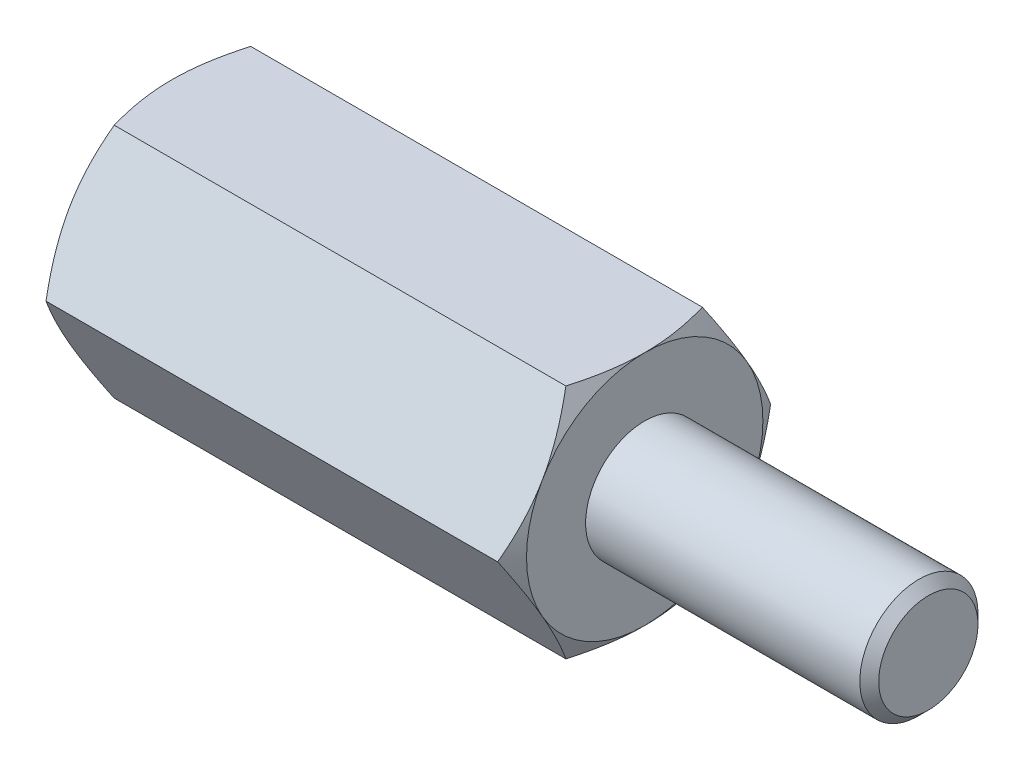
ISO-10303-21;
HEADER;
FILE_DESCRIPTION(('STEP AP214'),'2;1');
FILE_NAME('part.step','',(''),(''),'','','');
FILE_SCHEMA(('AUTOMOTIVE_DESIGN { 1 0 10303 214 1 1 1 1 }'));
ENDSEC;
DATA;
#1=APPLICATION_CONTEXT('core data for automotive mechanical design processes');
#2=APPLICATION_PROTOCOL_DEFINITION('international standard','automotive_design',2000,#1);
#3=PRODUCT_CONTEXT('',#1,'mechanical');
#4=PRODUCT('Part','Part','',(#3));
#5=PRODUCT_RELATED_PRODUCT_CATEGORY('part','',(#4));
#6=PRODUCT_DEFINITION_FORMATION('','',#4);
#7=PRODUCT_DEFINITION_CONTEXT('part definition',#1,'design');
#8=PRODUCT_DEFINITION('design','',#6,#7);
#9=PRODUCT_DEFINITION_SHAPE('','',#8);
#10=(LENGTH_UNIT() NAMED_UNIT(*) SI_UNIT(.MILLI.,.METRE.));
#11=(NAMED_UNIT(*) PLANE_ANGLE_UNIT() SI_UNIT($,.RADIAN.));
#12=(NAMED_UNIT(*) SI_UNIT($,.STERADIAN.) SOLID_ANGLE_UNIT());
#13=UNCERTAINTY_MEASURE_WITH_UNIT(LENGTH_MEASURE(1.E-05),#10,'distance_accuracy_value','');
#14=(GEOMETRIC_REPRESENTATION_CONTEXT(3) GLOBAL_UNCERTAINTY_ASSIGNED_CONTEXT((#13)) GLOBAL_UNIT_ASSIGNED_CONTEXT((#10,
#11,#12)) REPRESENTATION_CONTEXT('',''));
#15=CARTESIAN_POINT('',(0.,0.,0.));
#16=DIRECTION('',(0.,0.,1.));
#17=DIRECTION('',(1.,0.,0.));
#18=AXIS2_PLACEMENT_3D('',#15,#16,#17);
#19=CARTESIAN_POINT('',(5.,2.5,-1.44337567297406));
#20=DIRECTION('',(1.,0.,0.));
#21=DIRECTION('',(0.,0.,-1.));
#22=AXIS2_PLACEMENT_3D('',#19,#20,#21);
#23=PLANE('',#22);
#24=CARTESIAN_POINT('',(5.,0.,0.));
#25=DIRECTION('',(1.,0.,0.));
#26=DIRECTION('',(0.,0.,-1.));
#27=AXIS2_PLACEMENT_3D('',#24,#25,#26);
#28=CIRCLE('',#27,2.5);
#29=CARTESIAN_POINT('',(5.,-1.25,-2.1650635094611));
#30=VERTEX_POINT('',#29);
#31=CARTESIAN_POINT('',(5.,1.25,-2.1650635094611));
#32=VERTEX_POINT('',#31);
#33=EDGE_CURVE('E288',#30,#32,#28,.T.);
#34=ORIENTED_EDGE('',*,*,#33,.T.);
#35=CARTESIAN_POINT('',(5.,2.5,0.));
#36=VERTEX_POINT('',#35);
#37=EDGE_CURVE('E53',#32,#36,#28,.T.);
#38=ORIENTED_EDGE('',*,*,#37,.T.);
#39=CARTESIAN_POINT('',(5.,1.25,2.1650635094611));
#40=VERTEX_POINT('',#39);
#41=EDGE_CURVE('E295',#36,#40,#28,.T.);
#42=ORIENTED_EDGE('',*,*,#41,.T.);
#43=CARTESIAN_POINT('',(5.,-1.25,2.1650635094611));
#44=VERTEX_POINT('',#43);
#45=EDGE_CURVE('E300',#40,#44,#28,.T.);
#46=ORIENTED_EDGE('',*,*,#45,.T.);
#47=CARTESIAN_POINT('',(5.,0.,0.));
#48=DIRECTION('',(-1.,0.,0.));
#49=DIRECTION('',(0.,-1.,0.));
#50=AXIS2_PLACEMENT_3D('',#47,#48,#49);
#51=CIRCLE('',#50,2.5);
#52=CARTESIAN_POINT('',(5.,-2.5,0.));
#53=VERTEX_POINT('',#52);
#54=EDGE_CURVE('E193',#53,#44,#51,.T.);
#55=ORIENTED_EDGE('',*,*,#54,.F.);
#56=EDGE_CURVE('E61',#53,#30,#28,.T.);
#57=ORIENTED_EDGE('',*,*,#56,.T.);
#58=EDGE_LOOP('',(#34,#38,#42,#46,#55,#57));
#59=FACE_BOUND('',#58,.T.);
#60=CARTESIAN_POINT('',(5.,0.,0.));
#61=DIRECTION('',(1.,0.,0.));
#62=DIRECTION('',(0.,0.,-1.));
#63=AXIS2_PLACEMENT_3D('',#60,#61,#62);
#64=CIRCLE('',#63,1.25);
#65=CARTESIAN_POINT('',(5.,0.,-1.25));
#66=VERTEX_POINT('',#65);
#67=EDGE_CURVE('E328',#66,#66,#64,.T.);
#68=ORIENTED_EDGE('',*,*,#67,.F.);
#69=EDGE_LOOP('',(#68));
#70=FACE_BOUND('',#69,.T.);
#71=ADVANCED_FACE('F37',(#59,#70),#23,.T.);
#72=CARTESIAN_POINT('',(5.,0.,-2.88675134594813));
#73=DIRECTION('',(0.,-0.5,0.866025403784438));
#74=DIRECTION('',(0.,-0.866025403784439,-0.5));
#75=AXIS2_PLACEMENT_3D('',#72,#73,#74);
#76=PLANE('',#75);
#77=CARTESIAN_POINT('',(4.77664233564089,-0.000199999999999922,-2.88686681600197));
#78=CARTESIAN_POINT('',(4.81327837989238,0.109663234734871,-2.82343724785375));
#79=CARTESIAN_POINT('',(4.84659778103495,0.220474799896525,-2.75946016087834));
#80=CARTESIAN_POINT('',(4.90475771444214,0.444016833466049,-2.63039810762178));
#81=CARTESIAN_POINT('',(4.92957767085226,0.556751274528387,-2.5653108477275));
#82=CARTESIAN_POINT('',(4.96821434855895,0.780822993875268,-2.43594298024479));
#83=CARTESIAN_POINT('',(4.98228820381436,0.892125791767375,-2.37168227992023));
#84=CARTESIAN_POINT('',(4.99909084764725,1.11525522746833,-2.24285844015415));
#85=CARTESIAN_POINT('',(5.00183354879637,1.22708105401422,-2.17829576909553));
#86=CARTESIAN_POINT('',(4.99613423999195,1.43604197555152,-2.05765212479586));
#87=CARTESIAN_POINT('',(4.98909160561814,1.53320831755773,-2.0015531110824));
#88=CARTESIAN_POINT('',(4.96676858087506,1.726907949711,-1.88972057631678));
#89=CARTESIAN_POINT('',(4.95148056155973,1.82344056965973,-1.8339874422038));
#90=CARTESIAN_POINT('',(4.91326090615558,2.01753972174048,-1.7219242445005));
#91=CARTESIAN_POINT('',(4.89016722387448,2.11508168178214,-1.66560836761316));
#92=CARTESIAN_POINT('',(4.83775334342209,2.30871060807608,-1.55381665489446));
#93=CARTESIAN_POINT('',(4.80844546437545,2.40480005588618,-1.49833938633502));
#94=CARTESIAN_POINT('',(4.77664233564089,2.5002,-1.44326020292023));
#95=B_SPLINE_CURVE_WITH_KNOTS('',3,(#77,#78,#79,#80,#81,#82,#83,#84,#85,#86,#87,#88,#89,#90,#91,
#92,#93,#94),.UNSPECIFIED.,.F.,.F.,(4,2,2,2,2,2,2,2,4),(0.,0.396285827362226,0.79352433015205,
1.18093086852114,1.56786160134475,1.90479741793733,2.24204551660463,2.58677531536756,
2.93082800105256),.UNSPECIFIED.);
#96=CARTESIAN_POINT('',(4.7767090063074,0.,-2.88675134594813));
#97=VERTEX_POINT('',#96);
#98=EDGE_CURVE('E312',#97,#32,#95,.T.);
#99=ORIENTED_EDGE('',*,*,#98,.F.);
#100=DIRECTION('',(-1.,0.,0.));
#101=VECTOR('',#100,1.);
#102=CARTESIAN_POINT('',(5.,0.,-2.88675134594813));
#103=LINE('',#102,#101);
#104=CARTESIAN_POINT('',(-4.7767090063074,0.,-2.88675134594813));
#105=VERTEX_POINT('',#104);
#106=EDGE_CURVE('E264',#97,#105,#103,.T.);
#107=ORIENTED_EDGE('',*,*,#106,.T.);
#108=CARTESIAN_POINT('',(-4.77664233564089,2.5002,-1.44326020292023));
#109=CARTESIAN_POINT('',(-4.81327837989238,2.39033676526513,-1.50668977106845));
#110=CARTESIAN_POINT('',(-4.84659778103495,2.27952520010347,-1.57066685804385));
#111=CARTESIAN_POINT('',(-4.90475771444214,2.05598316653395,-1.69972891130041));
#112=CARTESIAN_POINT('',(-4.92957767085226,1.94324872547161,-1.7648161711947));
#113=CARTESIAN_POINT('',(-4.96821434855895,1.71917700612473,-1.8941840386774));
#114=CARTESIAN_POINT('',(-4.98228820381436,1.60787420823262,-1.95844473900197));
#115=CARTESIAN_POINT('',(-4.99909084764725,1.38474477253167,-2.08726857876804));
#116=CARTESIAN_POINT('',(-5.00183354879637,1.27291894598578,-2.15183124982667));
#117=CARTESIAN_POINT('',(-4.99613423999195,1.06395802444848,-2.27247489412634));
#118=CARTESIAN_POINT('',(-4.98909160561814,0.966791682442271,-2.32857390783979));
#119=CARTESIAN_POINT('',(-4.96676858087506,0.773092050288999,-2.44040644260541));
#120=CARTESIAN_POINT('',(-4.95148056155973,0.676559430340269,-2.49613957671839));
#121=CARTESIAN_POINT('',(-4.91326090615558,0.482460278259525,-2.60820277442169));
#122=CARTESIAN_POINT('',(-4.89016722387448,0.384918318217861,-2.66451865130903));
#123=CARTESIAN_POINT('',(-4.83775334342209,0.191289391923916,-2.77631036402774));
#124=CARTESIAN_POINT('',(-4.80844546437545,0.0951999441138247,-2.83178763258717));
#125=CARTESIAN_POINT('',(-4.77664233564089,-0.000199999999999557,-2.88686681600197));
#126=B_SPLINE_CURVE_WITH_KNOTS('',3,(#108,#109,#110,#111,#112,#113,#114,#115,#116,#117,#118,
#119,#120,#121,#122,#123,#124,#125),.UNSPECIFIED.,.F.,.F.,(4,2,2,2,2,2,2,2,4),(0.,
0.396285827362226,0.793524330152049,1.18093086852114,1.56786160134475,1.90479741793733,
2.24204551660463,2.58677531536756,2.93082800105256),.UNSPECIFIED.);
#127=CARTESIAN_POINT('',(-5.,1.25,-2.1650635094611));
#128=VERTEX_POINT('',#127);
#129=EDGE_CURVE('E319',#128,#105,#126,.T.);
#130=ORIENTED_EDGE('',*,*,#129,.F.);
#131=CARTESIAN_POINT('',(-4.7767090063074,2.5,-1.44337567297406));
#132=VERTEX_POINT('',#131);
#133=EDGE_CURVE('E322',#132,#128,#126,.T.);
#134=ORIENTED_EDGE('',*,*,#133,.F.);
#135=DIRECTION('',(-1.,0.,0.));
#136=VECTOR('',#135,1.);
#137=CARTESIAN_POINT('',(5.,2.5,-1.44337567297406));
#138=LINE('',#137,#136);
#139=CARTESIAN_POINT('',(4.77670900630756,2.5,-1.44337567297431));
#140=VERTEX_POINT('',#139);
#141=EDGE_CURVE('E279',#140,#132,#138,.T.);
#142=ORIENTED_EDGE('',*,*,#141,.F.);
#143=EDGE_CURVE('E229',#32,#140,#95,.T.);
#144=ORIENTED_EDGE('',*,*,#143,.F.);
#145=EDGE_LOOP('',(#99,#107,#130,#134,#142,#144));
#146=FACE_BOUND('',#145,.T.);
#147=ADVANCED_FACE('F148',(#146),#76,.F.);
#148=CARTESIAN_POINT('',(5.,2.5,-1.44337567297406));
#149=DIRECTION('',(0.,-1.,0.));
#150=DIRECTION('',(0.,0.,-1.));
#151=AXIS2_PLACEMENT_3D('',#148,#149,#150);
#152=PLANE('',#151);
#153=CARTESIAN_POINT('',(3.76803388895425,2.5,-3.90158441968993));
#154=CARTESIAN_POINT('',(3.82120772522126,2.5,-3.79217004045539));
#155=CARTESIAN_POINT('',(3.87387869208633,2.5,-3.68250707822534));
#156=CARTESIAN_POINT('',(3.97793249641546,2.5,-3.46255185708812));
#157=CARTESIAN_POINT('',(4.02931513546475,2.5,-3.35225950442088));
#158=CARTESIAN_POINT('',(4.13076309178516,2.5,-3.130356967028));
#159=CARTESIAN_POINT('',(4.18081992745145,2.5,-3.01874289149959));
#160=CARTESIAN_POINT('',(4.27891712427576,2.5,-2.79463535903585));
#161=CARTESIAN_POINT('',(4.32695757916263,2.5,-2.68214194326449));
#162=CARTESIAN_POINT('',(4.42201845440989,2.5,-2.45240385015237));
#163=CARTESIAN_POINT('',(4.46895431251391,2.5,-2.33512399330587));
#164=CARTESIAN_POINT('',(4.55933269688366,2.5,-2.09920133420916));
#165=CARTESIAN_POINT('',(4.60277483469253,2.5,-1.98055838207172));
#166=CARTESIAN_POINT('',(4.68504351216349,2.5,-1.74193489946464));
#167=CARTESIAN_POINT('',(4.72387917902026,2.5,-1.6219575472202));
#168=CARTESIAN_POINT('',(4.79570507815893,2.5,-1.38028205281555));
#169=CARTESIAN_POINT('',(4.82869712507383,2.5,-1.25858445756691));
#170=CARTESIAN_POINT('',(4.88709594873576,2.5,-1.01406369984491));
#171=CARTESIAN_POINT('',(4.91254379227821,2.5,-0.891250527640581));
#172=CARTESIAN_POINT('',(4.95442751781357,2.5,-0.644071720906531));
#173=CARTESIAN_POINT('',(4.97086432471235,2.5,-0.519706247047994));
#174=CARTESIAN_POINT('',(4.9932006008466,2.5,-0.271679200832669));
#175=CARTESIAN_POINT('',(4.99923751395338,2.5,-0.148030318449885));
#176=CARTESIAN_POINT('',(5.00062561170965,2.5,0.0993395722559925));
#177=CARTESIAN_POINT('',(4.99597656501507,2.5,0.223060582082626));
#178=CARTESIAN_POINT('',(4.97940443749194,2.5,0.432351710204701));
#179=CARTESIAN_POINT('',(4.97010665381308,2.5,0.518143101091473));
#180=CARTESIAN_POINT('',(4.94693847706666,2.5,0.689112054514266));
#181=CARTESIAN_POINT('',(4.93306748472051,2.5,0.774289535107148));
#182=CARTESIAN_POINT('',(4.88532020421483,2.5,1.02876599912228));
#183=CARTESIAN_POINT('',(4.84531764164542,2.5,1.19691958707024));
#184=CARTESIAN_POINT('',(4.75226567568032,2.5,1.53362893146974));
#185=CARTESIAN_POINT('',(4.69893620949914,2.5,1.70210423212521));
#186=CARTESIAN_POINT('',(4.61237169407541,2.5,1.95247339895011));
#187=CARTESIAN_POINT('',(4.58242477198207,2.5,2.03553184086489));
#188=CARTESIAN_POINT('',(4.52068409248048,2.5,2.20095860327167));
#189=CARTESIAN_POINT('',(4.48889037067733,2.5,2.2833269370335));
#190=CARTESIAN_POINT('',(4.40401426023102,2.5,2.49723312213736));
#191=CARTESIAN_POINT('',(4.34971733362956,2.5,2.6282879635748));
#192=CARTESIAN_POINT('',(4.23812739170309,2.5,2.88912034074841));
#193=CARTESIAN_POINT('',(4.1808341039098,2.5,3.01889775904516));
#194=CARTESIAN_POINT('',(4.06393487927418,2.5,3.27745045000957));
#195=CARTESIAN_POINT('',(4.00432825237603,2.5,3.40622540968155));
#196=CARTESIAN_POINT('',(3.8833234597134,2.5,3.66293235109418));
#197=CARTESIAN_POINT('',(3.82192524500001,2.5,3.79086430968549));
#198=CARTESIAN_POINT('',(3.6354580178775,2.5,4.17399495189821));
#199=CARTESIAN_POINT('',(3.50828249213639,2.5,4.42816724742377));
#200=CARTESIAN_POINT('',(3.25034557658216,2.5,4.93461464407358));
#201=CARTESIAN_POINT('',(3.11958483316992,2.5,5.18689007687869));
#202=CARTESIAN_POINT('',(2.86871001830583,2.5,5.66512451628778));
#203=CARTESIAN_POINT('',(2.74882986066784,2.5,5.89120644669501));
#204=CARTESIAN_POINT('',(2.50759021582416,2.5,6.34259369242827));
#205=CARTESIAN_POINT('',(2.38623065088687,2.5,6.56789896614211));
#206=CARTESIAN_POINT('',(2.14278038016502,2.5,7.01722044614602));
#207=CARTESIAN_POINT('',(2.02069305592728,2.5,7.24123848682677));
#208=CARTESIAN_POINT('',(1.77566624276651,2.5,7.68878772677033));
#209=CARTESIAN_POINT('',(1.65272681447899,2.5,7.9123189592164));
#210=CARTESIAN_POINT('',(1.52947566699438,2.5,8.13567697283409));
#211=B_SPLINE_CURVE_WITH_KNOTS('',3,(#153,#154,#155,#156,#157,#158,#159,#160,#161,#162,#163,
#164,#165,#166,#167,#168,#169,#170,#171,#172,#173,#174,#175,#176,#177,#178,#179,#180,#181,#182,
#183,#184,#185,#186,#187,#188,#189,#190,#191,#192,#193,#194,#195,#196,#197,#198,#199,#200,#201,
#202,#203,#204,#205,#206,#207,#208,#209,#210),.UNSPECIFIED.,.F.,.F.,(4,2,2,2,2,2,2,2,2,2,2,2,2,
2,2,2,2,2,2,2,2,2,2,2,2,2,2,2,4),(0.,0.364957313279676,0.729970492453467,1.09692930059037,
1.46387103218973,1.84279746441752,2.22176597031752,2.59997058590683,2.97805755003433,
3.35404692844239,3.72999770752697,4.10094071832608,4.47189175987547,4.73064905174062,
4.98944026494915,5.5072907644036,6.03710483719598,6.30196454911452,6.56681915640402,
6.99233818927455,7.41789598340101,7.84358170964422,8.26927907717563,9.12186602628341,
9.9743002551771,10.7419897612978,11.5097197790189,12.2750964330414,13.0404191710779),.UNSPECIFIED.);
#212=EDGE_CURVE('E227',#140,#36,#211,.T.);
#213=ORIENTED_EDGE('',*,*,#212,.F.);
#214=ORIENTED_EDGE('',*,*,#141,.T.);
#215=CARTESIAN_POINT('',(-3.76803388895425,2.5,-3.90158441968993));
#216=CARTESIAN_POINT('',(-3.82120772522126,2.5,-3.79217004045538));
#217=CARTESIAN_POINT('',(-3.87387869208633,2.5,-3.68250707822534));
#218=CARTESIAN_POINT('',(-3.97793249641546,2.5,-3.46255185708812));
#219=CARTESIAN_POINT('',(-4.02931513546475,2.5,-3.35225950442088));
#220=CARTESIAN_POINT('',(-4.13076309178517,2.5,-3.130356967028));
#221=CARTESIAN_POINT('',(-4.18081992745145,2.5,-3.01874289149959));
#222=CARTESIAN_POINT('',(-4.27891712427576,2.5,-2.79463535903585));
#223=CARTESIAN_POINT('',(-4.32695757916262,2.5,-2.68214194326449));
#224=CARTESIAN_POINT('',(-4.42201845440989,2.5,-2.45240385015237));
#225=CARTESIAN_POINT('',(-4.46895431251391,2.5,-2.33512399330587));
#226=CARTESIAN_POINT('',(-4.55933269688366,2.5,-2.09920133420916));
#227=CARTESIAN_POINT('',(-4.60277483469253,2.5,-1.98055838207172));
#228=CARTESIAN_POINT('',(-4.68504351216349,2.5,-1.74193489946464));
#229=CARTESIAN_POINT('',(-4.72387917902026,2.5,-1.6219575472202));
#230=CARTESIAN_POINT('',(-4.79570507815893,2.5,-1.38028205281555));
#231=CARTESIAN_POINT('',(-4.82869712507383,2.5,-1.25858445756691));
#232=CARTESIAN_POINT('',(-4.88709594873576,2.5,-1.01406369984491));
#233=CARTESIAN_POINT('',(-4.91254379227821,2.5,-0.891250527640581));
#234=CARTESIAN_POINT('',(-4.95442751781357,2.5,-0.64407172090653));
#235=CARTESIAN_POINT('',(-4.97086432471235,2.5,-0.519706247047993));
#236=CARTESIAN_POINT('',(-4.9932006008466,2.5,-0.271679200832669));
#237=CARTESIAN_POINT('',(-4.99923751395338,2.5,-0.148030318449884));
#238=CARTESIAN_POINT('',(-5.00062561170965,2.5,0.0993395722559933));
#239=CARTESIAN_POINT('',(-4.99597656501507,2.5,0.223060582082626));
#240=CARTESIAN_POINT('',(-4.97940443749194,2.5,0.432351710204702));
#241=CARTESIAN_POINT('',(-4.97010665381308,2.5,0.518143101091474));
#242=CARTESIAN_POINT('',(-4.94693847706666,2.5,0.689112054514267));
#243=CARTESIAN_POINT('',(-4.93306748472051,2.5,0.774289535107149));
#244=CARTESIAN_POINT('',(-4.88532020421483,2.5,1.02876599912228));
#245=CARTESIAN_POINT('',(-4.84531764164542,2.5,1.19691958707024));
#246=CARTESIAN_POINT('',(-4.75226567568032,2.5,1.53362893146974));
#247=CARTESIAN_POINT('',(-4.69893620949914,2.5,1.70210423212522));
#248=CARTESIAN_POINT('',(-4.61237169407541,2.5,1.95247339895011));
#249=CARTESIAN_POINT('',(-4.58242477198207,2.5,2.03553184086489));
#250=CARTESIAN_POINT('',(-4.52068409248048,2.5,2.20095860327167));
#251=CARTESIAN_POINT('',(-4.48889037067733,2.5,2.2833269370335));
#252=CARTESIAN_POINT('',(-4.40401426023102,2.5,2.49723312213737));
#253=CARTESIAN_POINT('',(-4.34971733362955,2.5,2.6282879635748));
#254=CARTESIAN_POINT('',(-4.23812739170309,2.5,2.88912034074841));
#255=CARTESIAN_POINT('',(-4.1808341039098,2.5,3.01889775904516));
#256=CARTESIAN_POINT('',(-4.06393487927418,2.5,3.27745045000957));
#257=CARTESIAN_POINT('',(-4.00432825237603,2.5,3.40622540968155));
#258=CARTESIAN_POINT('',(-3.8833234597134,2.5,3.66293235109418));
#259=CARTESIAN_POINT('',(-3.82192524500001,2.5,3.79086430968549));
#260=CARTESIAN_POINT('',(-3.6354580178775,2.5,4.17399495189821));
#261=CARTESIAN_POINT('',(-3.50828249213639,2.5,4.42816724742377));
#262=CARTESIAN_POINT('',(-3.25034557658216,2.5,4.93461464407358));
#263=CARTESIAN_POINT('',(-3.11958483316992,2.5,5.18689007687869));
#264=CARTESIAN_POINT('',(-2.86871001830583,2.5,5.66512451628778));
#265=CARTESIAN_POINT('',(-2.74882986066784,2.5,5.89120644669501));
#266=CARTESIAN_POINT('',(-2.50759021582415,2.5,6.34259369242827));
#267=CARTESIAN_POINT('',(-2.38623065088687,2.5,6.56789896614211));
#268=CARTESIAN_POINT('',(-2.14278038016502,2.5,7.01722044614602));
#269=CARTESIAN_POINT('',(-2.02069305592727,2.5,7.24123848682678));
#270=CARTESIAN_POINT('',(-1.77566624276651,2.5,7.68878772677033));
#271=CARTESIAN_POINT('',(-1.65272681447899,2.5,7.9123189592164));
#272=CARTESIAN_POINT('',(-1.52947566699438,2.5,8.13567697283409));
#273=B_SPLINE_CURVE_WITH_KNOTS('',3,(#215,#216,#217,#218,#219,#220,#221,#222,#223,#224,#225,
#226,#227,#228,#229,#230,#231,#232,#233,#234,#235,#236,#237,#238,#239,#240,#241,#242,#243,#244,
#245,#246,#247,#248,#249,#250,#251,#252,#253,#254,#255,#256,#257,#258,#259,#260,#261,#262,#263,
#264,#265,#266,#267,#268,#269,#270,#271,#272),.UNSPECIFIED.,.F.,.F.,(4,2,2,2,2,2,2,2,2,2,2,2,2,
2,2,2,2,2,2,2,2,2,2,2,2,2,2,2,4),(0.,0.364957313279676,0.729970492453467,1.09692930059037,
1.46387103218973,1.84279746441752,2.22176597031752,2.59997058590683,2.97805755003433,
3.35404692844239,3.72999770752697,4.10094071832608,4.47189175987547,4.73064905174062,
4.98944026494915,5.5072907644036,6.03710483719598,6.30196454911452,6.56681915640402,
6.99233818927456,7.41789598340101,7.84358170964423,8.26927907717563,9.12186602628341,
9.97430025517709,10.7419897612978,11.5097197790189,12.2750964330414,13.0404191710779),.UNSPECIFIED.);
#274=CARTESIAN_POINT('',(-5.,2.5,0.));
#275=VERTEX_POINT('',#274);
#276=EDGE_CURVE('E241',#275,#132,#273,.F.);
#277=ORIENTED_EDGE('',*,*,#276,.F.);
#278=CARTESIAN_POINT('',(-4.7767090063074,2.5,1.44337567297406));
#279=VERTEX_POINT('',#278);
#280=EDGE_CURVE('E249',#279,#275,#273,.F.);
#281=ORIENTED_EDGE('',*,*,#280,.F.);
#282=DIRECTION('',(-1.,0.,0.));
#283=VECTOR('',#282,1.);
#284=CARTESIAN_POINT('',(5.,2.5,1.44337567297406));
#285=LINE('',#284,#283);
#286=CARTESIAN_POINT('',(4.7767090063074,2.5,1.44337567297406));
#287=VERTEX_POINT('',#286);
#288=EDGE_CURVE('E276',#287,#279,#285,.T.);
#289=ORIENTED_EDGE('',*,*,#288,.F.);
#290=EDGE_CURVE('E221',#36,#287,#211,.T.);
#291=ORIENTED_EDGE('',*,*,#290,.F.);
#292=EDGE_LOOP('',(#213,#214,#277,#281,#289,#291));
#293=FACE_BOUND('',#292,.T.);
#294=ADVANCED_FACE('F153',(#293),#152,.F.);
#295=CARTESIAN_POINT('',(5.,2.5,1.44337567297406));
#296=DIRECTION('',(0.,-0.5,-0.866025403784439));
#297=DIRECTION('',(0.,0.866025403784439,-0.5));
#298=AXIS2_PLACEMENT_3D('',#295,#296,#297);
#299=PLANE('',#298);
#300=CARTESIAN_POINT('',(4.77664233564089,2.5002,1.44326020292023));
#301=CARTESIAN_POINT('',(4.81327837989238,2.39033676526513,1.50668977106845));
#302=CARTESIAN_POINT('',(4.84659778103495,2.27952520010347,1.57066685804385));
#303=CARTESIAN_POINT('',(4.90475771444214,2.05598316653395,1.69972891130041));
#304=CARTESIAN_POINT('',(4.92957767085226,1.94324872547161,1.7648161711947));
#305=CARTESIAN_POINT('',(4.96821434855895,1.71917700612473,1.8941840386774));
#306=CARTESIAN_POINT('',(4.98228820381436,1.60787420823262,1.95844473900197));
#307=CARTESIAN_POINT('',(4.99909084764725,1.38474477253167,2.08726857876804));
#308=CARTESIAN_POINT('',(5.00183354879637,1.27291894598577,2.15183124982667));
#309=CARTESIAN_POINT('',(4.99613423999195,1.06395802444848,2.27247489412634));
#310=CARTESIAN_POINT('',(4.98909160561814,0.96679168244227,2.32857390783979));
#311=CARTESIAN_POINT('',(4.96676858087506,0.773092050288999,2.44040644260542));
#312=CARTESIAN_POINT('',(4.95148056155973,0.676559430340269,2.49613957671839));
#313=CARTESIAN_POINT('',(4.91326090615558,0.482460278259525,2.60820277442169));
#314=CARTESIAN_POINT('',(4.89016722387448,0.384918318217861,2.66451865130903));
#315=CARTESIAN_POINT('',(4.83775334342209,0.191289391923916,2.77631036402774));
#316=CARTESIAN_POINT('',(4.80844546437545,0.0951999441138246,2.83178763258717));
#317=CARTESIAN_POINT('',(4.77664233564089,-0.000199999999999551,2.88686681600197));
#318=B_SPLINE_CURVE_WITH_KNOTS('',3,(#300,#301,#302,#303,#304,#305,#306,#307,#308,#309,#310,
#311,#312,#313,#314,#315,#316,#317),.UNSPECIFIED.,.F.,.F.,(4,2,2,2,2,2,2,2,4),(0.,
0.396285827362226,0.79352433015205,1.18093086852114,1.56786160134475,1.90479741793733,
2.24204551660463,2.58677531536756,2.93082800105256),.UNSPECIFIED.);
#319=EDGE_CURVE('E228',#287,#40,#318,.T.);
#320=ORIENTED_EDGE('',*,*,#319,.F.);
#321=ORIENTED_EDGE('',*,*,#288,.T.);
#322=CARTESIAN_POINT('',(-4.77664233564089,-0.000199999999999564,2.88686681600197));
#323=CARTESIAN_POINT('',(-4.81327837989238,0.109663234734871,2.82343724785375));
#324=CARTESIAN_POINT('',(-4.84659778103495,0.220474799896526,2.75946016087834));
#325=CARTESIAN_POINT('',(-4.90475771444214,0.44401683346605,2.63039810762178));
#326=CARTESIAN_POINT('',(-4.92957767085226,0.556751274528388,2.5653108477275));
#327=CARTESIAN_POINT('',(-4.96821434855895,0.780822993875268,2.43594298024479));
#328=CARTESIAN_POINT('',(-4.98228820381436,0.892125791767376,2.37168227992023));
#329=CARTESIAN_POINT('',(-4.99909084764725,1.11525522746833,2.24285844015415));
#330=CARTESIAN_POINT('',(-5.00183354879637,1.22708105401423,2.17829576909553));
#331=CARTESIAN_POINT('',(-4.99613423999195,1.43604197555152,2.05765212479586));
#332=CARTESIAN_POINT('',(-4.98909160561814,1.53320831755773,2.0015531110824));
#333=CARTESIAN_POINT('',(-4.96676858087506,1.726907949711,1.88972057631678));
#334=CARTESIAN_POINT('',(-4.95148056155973,1.82344056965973,1.8339874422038));
#335=CARTESIAN_POINT('',(-4.91326090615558,2.01753972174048,1.7219242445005));
#336=CARTESIAN_POINT('',(-4.89016722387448,2.11508168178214,1.66560836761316));
#337=CARTESIAN_POINT('',(-4.83775334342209,2.30871060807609,1.55381665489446));
#338=CARTESIAN_POINT('',(-4.80844546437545,2.40480005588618,1.49833938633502));
#339=CARTESIAN_POINT('',(-4.77664233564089,2.5002,1.44326020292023));
#340=B_SPLINE_CURVE_WITH_KNOTS('',3,(#322,#323,#324,#325,#326,#327,#328,#329,#330,#331,#332,
#333,#334,#335,#336,#337,#338,#339),.UNSPECIFIED.,.F.,.F.,(4,2,2,2,2,2,2,2,4),(0.,
0.396285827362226,0.79352433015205,1.18093086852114,1.56786160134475,1.90479741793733,
2.24204551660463,2.58677531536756,2.93082800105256),.UNSPECIFIED.);
#341=CARTESIAN_POINT('',(-5.,1.25,2.1650635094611));
#342=VERTEX_POINT('',#341);
#343=EDGE_CURVE('E255',#342,#279,#340,.T.);
#344=ORIENTED_EDGE('',*,*,#343,.F.);
#345=CARTESIAN_POINT('',(-4.7767090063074,0.,2.88675134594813));
#346=VERTEX_POINT('',#345);
#347=EDGE_CURVE('E262',#346,#342,#340,.T.);
#348=ORIENTED_EDGE('',*,*,#347,.F.);
#349=DIRECTION('',(-1.,0.,0.));
#350=VECTOR('',#349,1.);
#351=CARTESIAN_POINT('',(5.,0.,2.88675134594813));
#352=LINE('',#351,#350);
#353=CARTESIAN_POINT('',(4.7767090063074,0.,2.88675134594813));
#354=VERTEX_POINT('',#353);
#355=EDGE_CURVE('E273',#354,#346,#352,.T.);
#356=ORIENTED_EDGE('',*,*,#355,.F.);
#357=EDGE_CURVE('E215',#40,#354,#318,.T.);
#358=ORIENTED_EDGE('',*,*,#357,.F.);
#359=EDGE_LOOP('',(#320,#321,#344,#348,#356,#358));
#360=FACE_BOUND('',#359,.T.);
#361=ADVANCED_FACE('F235',(#360),#299,.F.);
#362=CARTESIAN_POINT('',(5.,0.,2.88675134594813));
#363=DIRECTION('',(0.,0.5,-0.866025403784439));
#364=DIRECTION('',(0.,0.866025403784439,0.5));
#365=AXIS2_PLACEMENT_3D('',#362,#363,#364);
#366=PLANE('',#365);
#367=CARTESIAN_POINT('',(4.77664233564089,0.000200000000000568,2.88686681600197));
#368=CARTESIAN_POINT('',(4.81327837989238,-0.10966323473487,2.82343724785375));
#369=CARTESIAN_POINT('',(4.84659778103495,-0.220474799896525,2.75946016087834));
#370=CARTESIAN_POINT('',(4.90475771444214,-0.444016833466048,2.63039810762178));
#371=CARTESIAN_POINT('',(4.92957767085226,-0.556751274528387,2.5653108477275));
#372=CARTESIAN_POINT('',(4.96821434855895,-0.780822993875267,2.43594298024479));
#373=CARTESIAN_POINT('',(4.98228820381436,-0.892125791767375,2.37168227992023));
#374=CARTESIAN_POINT('',(4.99909084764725,-1.11525522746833,2.24285844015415));
#375=CARTESIAN_POINT('',(5.00183354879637,-1.22708105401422,2.17829576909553));
#376=CARTESIAN_POINT('',(4.99613423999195,-1.43604197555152,2.05765212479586));
#377=CARTESIAN_POINT('',(4.98909160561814,-1.53320831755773,2.0015531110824));
#378=CARTESIAN_POINT('',(4.96676858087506,-1.726907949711,1.88972057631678));
#379=CARTESIAN_POINT('',(4.95148056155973,-1.82344056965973,1.8339874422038));
#380=CARTESIAN_POINT('',(4.91326090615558,-2.01753972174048,1.7219242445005));
#381=CARTESIAN_POINT('',(4.89016722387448,-2.11508168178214,1.66560836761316));
#382=CARTESIAN_POINT('',(4.83775334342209,-2.30871060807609,1.55381665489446));
#383=CARTESIAN_POINT('',(4.80844546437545,-2.40480005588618,1.49833938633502));
#384=CARTESIAN_POINT('',(4.77664233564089,-2.5002,1.44326020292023));
#385=B_SPLINE_CURVE_WITH_KNOTS('',3,(#367,#368,#369,#370,#371,#372,#373,#374,#375,#376,#377,
#378,#379,#380,#381,#382,#383,#384),.UNSPECIFIED.,.F.,.F.,(4,2,2,2,2,2,2,2,4),(0.,
0.396285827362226,0.793524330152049,1.18093086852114,1.56786160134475,1.90479741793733,
2.24204551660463,2.58677531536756,2.93082800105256),.UNSPECIFIED.);
#386=EDGE_CURVE('E343',#354,#44,#385,.T.);
#387=ORIENTED_EDGE('',*,*,#386,.F.);
#388=ORIENTED_EDGE('',*,*,#355,.T.);
#389=CARTESIAN_POINT('',(-4.77664233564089,-2.5002,1.44326020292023));
#390=CARTESIAN_POINT('',(-4.81327837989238,-2.39033676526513,1.50668977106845));
#391=CARTESIAN_POINT('',(-4.84659778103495,-2.27952520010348,1.57066685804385));
#392=CARTESIAN_POINT('',(-4.90475771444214,-2.05598316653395,1.69972891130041));
#393=CARTESIAN_POINT('',(-4.92957767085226,-1.94324872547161,1.7648161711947));
#394=CARTESIAN_POINT('',(-4.96821434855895,-1.71917700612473,1.8941840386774));
#395=CARTESIAN_POINT('',(-4.98228820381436,-1.60787420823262,1.95844473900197));
#396=CARTESIAN_POINT('',(-4.99909084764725,-1.38474477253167,2.08726857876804));
#397=CARTESIAN_POINT('',(-5.00183354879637,-1.27291894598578,2.15183124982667));
#398=CARTESIAN_POINT('',(-4.99613423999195,-1.06395802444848,2.27247489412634));
#399=CARTESIAN_POINT('',(-4.98909160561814,-0.96679168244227,2.32857390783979));
#400=CARTESIAN_POINT('',(-4.96676858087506,-0.773092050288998,2.44040644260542));
#401=CARTESIAN_POINT('',(-4.95148056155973,-0.676559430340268,2.49613957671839));
#402=CARTESIAN_POINT('',(-4.91326090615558,-0.482460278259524,2.60820277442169));
#403=CARTESIAN_POINT('',(-4.89016722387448,-0.384918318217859,2.66451865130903));
#404=CARTESIAN_POINT('',(-4.83775334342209,-0.191289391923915,2.77631036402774));
#405=CARTESIAN_POINT('',(-4.80844546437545,-0.0951999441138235,2.83178763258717));
#406=CARTESIAN_POINT('',(-4.77664233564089,0.000200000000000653,2.88686681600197));
#407=B_SPLINE_CURVE_WITH_KNOTS('',3,(#389,#390,#391,#392,#393,#394,#395,#396,#397,#398,#399,
#400,#401,#402,#403,#404,#405,#406),.UNSPECIFIED.,.F.,.F.,(4,2,2,2,2,2,2,2,4),(0.,
0.396285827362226,0.793524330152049,1.18093086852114,1.56786160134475,1.90479741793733,
2.24204551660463,2.58677531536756,2.93082800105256),.UNSPECIFIED.);
#408=CARTESIAN_POINT('',(-5.,-1.25,2.1650635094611));
#409=VERTEX_POINT('',#408);
#410=EDGE_CURVE('E263',#409,#346,#407,.T.);
#411=ORIENTED_EDGE('',*,*,#410,.F.);
#412=CARTESIAN_POINT('',(-4.7767090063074,-2.5,1.44337567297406));
#413=VERTEX_POINT('',#412);
#414=EDGE_CURVE('E250',#413,#409,#407,.T.);
#415=ORIENTED_EDGE('',*,*,#414,.F.);
#416=DIRECTION('',(-1.,0.,0.));
#417=VECTOR('',#416,1.);
#418=CARTESIAN_POINT('',(5.,-2.5,1.44337567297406));
#419=LINE('',#418,#417);
#420=CARTESIAN_POINT('',(4.7767090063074,-2.5,1.44337567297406));
#421=VERTEX_POINT('',#420);
#422=EDGE_CURVE('E270',#421,#413,#419,.T.);
#423=ORIENTED_EDGE('',*,*,#422,.F.);
#424=EDGE_CURVE('E210',#44,#421,#385,.T.);
#425=ORIENTED_EDGE('',*,*,#424,.F.);
#426=EDGE_LOOP('',(#387,#388,#411,#415,#423,#425));
#427=FACE_BOUND('',#426,.T.);
#428=ADVANCED_FACE('F392',(#427),#366,.F.);
#429=CARTESIAN_POINT('',(5.,-2.5,1.44337567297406));
#430=DIRECTION('',(0.,1.,0.));
#431=DIRECTION('',(0.,0.,1.));
#432=AXIS2_PLACEMENT_3D('',#429,#430,#431);
#433=PLANE('',#432);
#434=CARTESIAN_POINT('',(3.76803388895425,-2.5,-3.90158441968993));
#435=CARTESIAN_POINT('',(3.82120772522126,-2.5,-3.79217004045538));
#436=CARTESIAN_POINT('',(3.87387869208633,-2.5,-3.68250707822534));
#437=CARTESIAN_POINT('',(3.97793249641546,-2.5,-3.46255185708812));
#438=CARTESIAN_POINT('',(4.02931513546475,-2.5,-3.35225950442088));
#439=CARTESIAN_POINT('',(4.13076309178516,-2.5,-3.130356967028));
#440=CARTESIAN_POINT('',(4.18081992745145,-2.5,-3.01874289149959));
#441=CARTESIAN_POINT('',(4.27891712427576,-2.5,-2.79463535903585));
#442=CARTESIAN_POINT('',(4.32695757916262,-2.5,-2.68214194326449));
#443=CARTESIAN_POINT('',(4.42201845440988,-2.5,-2.45240385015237));
#444=CARTESIAN_POINT('',(4.46895431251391,-2.5,-2.33512399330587));
#445=CARTESIAN_POINT('',(4.55933269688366,-2.5,-2.09920133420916));
#446=CARTESIAN_POINT('',(4.60277483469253,-2.5,-1.98055838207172));
#447=CARTESIAN_POINT('',(4.68504351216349,-2.5,-1.74193489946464));
#448=CARTESIAN_POINT('',(4.72387917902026,-2.5,-1.6219575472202));
#449=CARTESIAN_POINT('',(4.79570507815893,-2.5,-1.38028205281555));
#450=CARTESIAN_POINT('',(4.82869712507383,-2.5,-1.25858445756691));
#451=CARTESIAN_POINT('',(4.88709594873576,-2.5,-1.01406369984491));
#452=CARTESIAN_POINT('',(4.91254379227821,-2.5,-0.891250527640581));
#453=CARTESIAN_POINT('',(4.95442751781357,-2.5,-0.644071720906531));
#454=CARTESIAN_POINT('',(4.97086432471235,-2.5,-0.519706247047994));
#455=CARTESIAN_POINT('',(4.9932006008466,-2.5,-0.27167920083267));
#456=CARTESIAN_POINT('',(4.99923751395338,-2.5,-0.148030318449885));
#457=CARTESIAN_POINT('',(5.00062561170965,-2.5,0.0993395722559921));
#458=CARTESIAN_POINT('',(4.99597656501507,-2.5,0.223060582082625));
#459=CARTESIAN_POINT('',(4.97940443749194,-2.5,0.4323517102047));
#460=CARTESIAN_POINT('',(4.97010665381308,-2.5,0.518143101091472));
#461=CARTESIAN_POINT('',(4.94693847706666,-2.5,0.689112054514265));
#462=CARTESIAN_POINT('',(4.93306748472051,-2.5,0.774289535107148));
#463=CARTESIAN_POINT('',(4.88532020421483,-2.5,1.02876599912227));
#464=CARTESIAN_POINT('',(4.84531764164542,-2.5,1.19691958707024));
#465=CARTESIAN_POINT('',(4.75226567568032,-2.5,1.53362893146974));
#466=CARTESIAN_POINT('',(4.69893620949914,-2.5,1.70210423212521));
#467=CARTESIAN_POINT('',(4.61237169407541,-2.5,1.95247339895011));
#468=CARTESIAN_POINT('',(4.58242477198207,-2.5,2.03553184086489));
#469=CARTESIAN_POINT('',(4.52068409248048,-2.5,2.20095860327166));
#470=CARTESIAN_POINT('',(4.48889037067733,-2.5,2.28332693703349));
#471=CARTESIAN_POINT('',(4.40401426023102,-2.5,2.49723312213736));
#472=CARTESIAN_POINT('',(4.34971733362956,-2.5,2.6282879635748));
#473=CARTESIAN_POINT('',(4.2381273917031,-2.5,2.88912034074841));
#474=CARTESIAN_POINT('',(4.1808341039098,-2.5,3.01889775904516));
#475=CARTESIAN_POINT('',(4.06393487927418,-2.5,3.27745045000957));
#476=CARTESIAN_POINT('',(4.00432825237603,-2.5,3.40622540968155));
#477=CARTESIAN_POINT('',(3.8833234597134,-2.5,3.66293235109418));
#478=CARTESIAN_POINT('',(3.82192524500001,-2.5,3.79086430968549));
#479=CARTESIAN_POINT('',(3.6354580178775,-2.5,4.17399495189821));
#480=CARTESIAN_POINT('',(3.50828249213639,-2.5,4.42816724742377));
#481=CARTESIAN_POINT('',(3.25034557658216,-2.5,4.93461464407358));
#482=CARTESIAN_POINT('',(3.11958483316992,-2.5,5.18689007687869));
#483=CARTESIAN_POINT('',(2.86871001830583,-2.5,5.66512451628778));
#484=CARTESIAN_POINT('',(2.74882986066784,-2.5,5.89120644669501));
#485=CARTESIAN_POINT('',(2.50759021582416,-2.5,6.34259369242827));
#486=CARTESIAN_POINT('',(2.38623065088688,-2.5,6.56789896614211));
#487=CARTESIAN_POINT('',(2.14278038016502,-2.5,7.01722044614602));
#488=CARTESIAN_POINT('',(2.02069305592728,-2.5,7.24123848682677));
#489=CARTESIAN_POINT('',(1.77566624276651,-2.5,7.68878772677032));
#490=CARTESIAN_POINT('',(1.65272681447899,-2.5,7.9123189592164));
#491=CARTESIAN_POINT('',(1.52947566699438,-2.5,8.13567697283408));
#492=B_SPLINE_CURVE_WITH_KNOTS('',3,(#434,#435,#436,#437,#438,#439,#440,#441,#442,#443,#444,
#445,#446,#447,#448,#449,#450,#451,#452,#453,#454,#455,#456,#457,#458,#459,#460,#461,#462,#463,
#464,#465,#466,#467,#468,#469,#470,#471,#472,#473,#474,#475,#476,#477,#478,#479,#480,#481,#482,
#483,#484,#485,#486,#487,#488,#489,#490,#491),.UNSPECIFIED.,.F.,.F.,(4,2,2,2,2,2,2,2,2,2,2,2,2,
2,2,2,2,2,2,2,2,2,2,2,2,2,2,2,4),(0.,0.364957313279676,0.729970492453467,1.09692930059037,
1.46387103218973,1.84279746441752,2.22176597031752,2.59997058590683,2.97805755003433,
3.35404692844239,3.72999770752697,4.10094071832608,4.47189175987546,4.73064905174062,
4.98944026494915,5.50729076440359,6.03710483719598,6.30196454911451,6.56681915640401,
6.99233818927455,7.41789598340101,7.84358170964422,8.26927907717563,9.12186602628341,
9.97430025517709,10.7419897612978,11.5097197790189,12.2750964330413,13.0404191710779),.UNSPECIFIED.);
#493=EDGE_CURVE('E337',#421,#53,#492,.F.);
#494=ORIENTED_EDGE('',*,*,#493,.F.);
#495=ORIENTED_EDGE('',*,*,#422,.T.);
#496=CARTESIAN_POINT('',(-3.76803388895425,-2.5,-3.90158441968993));
#497=CARTESIAN_POINT('',(-3.82120772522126,-2.5,-3.79217004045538));
#498=CARTESIAN_POINT('',(-3.87387869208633,-2.5,-3.68250707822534));
#499=CARTESIAN_POINT('',(-3.97793249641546,-2.5,-3.46255185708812));
#500=CARTESIAN_POINT('',(-4.02931513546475,-2.5,-3.35225950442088));
#501=CARTESIAN_POINT('',(-4.13076309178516,-2.5,-3.130356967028));
#502=CARTESIAN_POINT('',(-4.18081992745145,-2.5,-3.01874289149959));
#503=CARTESIAN_POINT('',(-4.27891712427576,-2.5,-2.79463535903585));
#504=CARTESIAN_POINT('',(-4.32695757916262,-2.5,-2.68214194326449));
#505=CARTESIAN_POINT('',(-4.42201845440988,-2.5,-2.45240385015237));
#506=CARTESIAN_POINT('',(-4.46895431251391,-2.5,-2.33512399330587));
#507=CARTESIAN_POINT('',(-4.55933269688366,-2.5,-2.09920133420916));
#508=CARTESIAN_POINT('',(-4.60277483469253,-2.5,-1.98055838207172));
#509=CARTESIAN_POINT('',(-4.68504351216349,-2.5,-1.74193489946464));
#510=CARTESIAN_POINT('',(-4.72387917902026,-2.5,-1.6219575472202));
#511=CARTESIAN_POINT('',(-4.79570507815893,-2.5,-1.38028205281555));
#512=CARTESIAN_POINT('',(-4.82869712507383,-2.5,-1.25858445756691));
#513=CARTESIAN_POINT('',(-4.88709594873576,-2.5,-1.01406369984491));
#514=CARTESIAN_POINT('',(-4.91254379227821,-2.5,-0.891250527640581));
#515=CARTESIAN_POINT('',(-4.95442751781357,-2.5,-0.644071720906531));
#516=CARTESIAN_POINT('',(-4.97086432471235,-2.5,-0.519706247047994));
#517=CARTESIAN_POINT('',(-4.9932006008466,-2.5,-0.27167920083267));
#518=CARTESIAN_POINT('',(-4.99923751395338,-2.5,-0.148030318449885));
#519=CARTESIAN_POINT('',(-5.00062561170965,-2.5,0.0993395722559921));
#520=CARTESIAN_POINT('',(-4.99597656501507,-2.5,0.223060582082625));
#521=CARTESIAN_POINT('',(-4.97940443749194,-2.5,0.432351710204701));
#522=CARTESIAN_POINT('',(-4.97010665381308,-2.5,0.518143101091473));
#523=CARTESIAN_POINT('',(-4.94693847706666,-2.5,0.689112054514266));
#524=CARTESIAN_POINT('',(-4.93306748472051,-2.5,0.774289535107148));
#525=CARTESIAN_POINT('',(-4.88532020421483,-2.5,1.02876599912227));
#526=CARTESIAN_POINT('',(-4.84531764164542,-2.5,1.19691958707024));
#527=CARTESIAN_POINT('',(-4.75226567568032,-2.5,1.53362893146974));
#528=CARTESIAN_POINT('',(-4.69893620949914,-2.5,1.70210423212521));
#529=CARTESIAN_POINT('',(-4.61237169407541,-2.5,1.95247339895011));
#530=CARTESIAN_POINT('',(-4.58242477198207,-2.5,2.03553184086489));
#531=CARTESIAN_POINT('',(-4.52068409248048,-2.5,2.20095860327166));
#532=CARTESIAN_POINT('',(-4.48889037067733,-2.5,2.28332693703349));
#533=CARTESIAN_POINT('',(-4.40401426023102,-2.5,2.49723312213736));
#534=CARTESIAN_POINT('',(-4.34971733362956,-2.5,2.6282879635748));
#535=CARTESIAN_POINT('',(-4.2381273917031,-2.5,2.88912034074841));
#536=CARTESIAN_POINT('',(-4.1808341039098,-2.5,3.01889775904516));
#537=CARTESIAN_POINT('',(-4.06393487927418,-2.5,3.27745045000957));
#538=CARTESIAN_POINT('',(-4.00432825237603,-2.5,3.40622540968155));
#539=CARTESIAN_POINT('',(-3.8833234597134,-2.5,3.66293235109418));
#540=CARTESIAN_POINT('',(-3.82192524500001,-2.5,3.79086430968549));
#541=CARTESIAN_POINT('',(-3.6354580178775,-2.5,4.17399495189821));
#542=CARTESIAN_POINT('',(-3.50828249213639,-2.5,4.42816724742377));
#543=CARTESIAN_POINT('',(-3.25034557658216,-2.5,4.93461464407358));
#544=CARTESIAN_POINT('',(-3.11958483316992,-2.5,5.18689007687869));
#545=CARTESIAN_POINT('',(-2.86871001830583,-2.5,5.66512451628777));
#546=CARTESIAN_POINT('',(-2.74882986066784,-2.5,5.89120644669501));
#547=CARTESIAN_POINT('',(-2.50759021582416,-2.5,6.34259369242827));
#548=CARTESIAN_POINT('',(-2.38623065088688,-2.5,6.56789896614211));
#549=CARTESIAN_POINT('',(-2.14278038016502,-2.5,7.01722044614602));
#550=CARTESIAN_POINT('',(-2.02069305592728,-2.5,7.24123848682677));
#551=CARTESIAN_POINT('',(-1.77566624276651,-2.5,7.68878772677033));
#552=CARTESIAN_POINT('',(-1.65272681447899,-2.5,7.9123189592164));
#553=CARTESIAN_POINT('',(-1.52947566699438,-2.5,8.13567697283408));
#554=B_SPLINE_CURVE_WITH_KNOTS('',3,(#496,#497,#498,#499,#500,#501,#502,#503,#504,#505,#506,
#507,#508,#509,#510,#511,#512,#513,#514,#515,#516,#517,#518,#519,#520,#521,#522,#523,#524,#525,
#526,#527,#528,#529,#530,#531,#532,#533,#534,#535,#536,#537,#538,#539,#540,#541,#542,#543,#544,
#545,#546,#547,#548,#549,#550,#551,#552,#553),.UNSPECIFIED.,.F.,.F.,(4,2,2,2,2,2,2,2,2,2,2,2,2,
2,2,2,2,2,2,2,2,2,2,2,2,2,2,2,4),(0.,0.364957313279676,0.729970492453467,1.09692930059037,
1.46387103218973,1.84279746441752,2.22176597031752,2.59997058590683,2.97805755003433,
3.35404692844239,3.72999770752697,4.10094071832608,4.47189175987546,4.73064905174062,
4.98944026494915,5.50729076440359,6.03710483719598,6.30196454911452,6.56681915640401,
6.99233818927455,7.41789598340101,7.84358170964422,8.26927907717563,9.12186602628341,
9.97430025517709,10.7419897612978,11.5097197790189,12.2750964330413,13.0404191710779),.UNSPECIFIED.);
#555=CARTESIAN_POINT('',(-5.,-2.5,0.));
#556=VERTEX_POINT('',#555);
#557=EDGE_CURVE('E340',#556,#413,#554,.T.);
#558=ORIENTED_EDGE('',*,*,#557,.F.);
#559=CARTESIAN_POINT('',(-4.7767090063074,-2.5,-1.44337567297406));
#560=VERTEX_POINT('',#559);
#561=EDGE_CURVE('E323',#560,#556,#554,.T.);
#562=ORIENTED_EDGE('',*,*,#561,.F.);
#563=DIRECTION('',(-1.,0.,0.));
#564=VECTOR('',#563,1.);
#565=CARTESIAN_POINT('',(5.,-2.5,-1.44337567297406));
#566=LINE('',#565,#564);
#567=CARTESIAN_POINT('',(4.7767090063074,-2.5,-1.44337567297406));
#568=VERTEX_POINT('',#567);
#569=EDGE_CURVE('E267',#568,#560,#566,.T.);
#570=ORIENTED_EDGE('',*,*,#569,.F.);
#571=EDGE_CURVE('E195',#53,#568,#492,.F.);
#572=ORIENTED_EDGE('',*,*,#571,.F.);
#573=EDGE_LOOP('',(#494,#495,#558,#562,#570,#572));
#574=FACE_BOUND('',#573,.T.);
#575=ADVANCED_FACE('F172',(#574),#433,.F.);
#576=CARTESIAN_POINT('',(5.,-2.5,-1.44337567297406));
#577=DIRECTION('',(0.,0.5,0.866025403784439));
#578=DIRECTION('',(0.,-0.866025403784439,0.5));
#579=AXIS2_PLACEMENT_3D('',#576,#577,#578);
#580=PLANE('',#579);
#581=CARTESIAN_POINT('',(4.77664233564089,-2.5002,-1.44326020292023));
#582=CARTESIAN_POINT('',(4.81327837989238,-2.39033676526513,-1.50668977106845));
#583=CARTESIAN_POINT('',(4.84659778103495,-2.27952520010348,-1.57066685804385));
#584=CARTESIAN_POINT('',(4.90475771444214,-2.05598316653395,-1.69972891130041));
#585=CARTESIAN_POINT('',(4.92957767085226,-1.94324872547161,-1.7648161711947));
#586=CARTESIAN_POINT('',(4.96821434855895,-1.71917700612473,-1.8941840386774));
#587=CARTESIAN_POINT('',(4.98228820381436,-1.60787420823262,-1.95844473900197));
#588=CARTESIAN_POINT('',(4.99909084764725,-1.38474477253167,-2.08726857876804));
#589=CARTESIAN_POINT('',(5.00183354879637,-1.27291894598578,-2.15183124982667));
#590=CARTESIAN_POINT('',(4.99613423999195,-1.06395802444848,-2.27247489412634));
#591=CARTESIAN_POINT('',(4.98909160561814,-0.966791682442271,-2.32857390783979));
#592=CARTESIAN_POINT('',(4.96676858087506,-0.773092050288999,-2.44040644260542));
#593=CARTESIAN_POINT('',(4.95148056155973,-0.676559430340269,-2.49613957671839));
#594=CARTESIAN_POINT('',(4.91326090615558,-0.482460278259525,-2.60820277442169));
#595=CARTESIAN_POINT('',(4.89016722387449,-0.38491831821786,-2.66451865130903));
#596=CARTESIAN_POINT('',(4.83775334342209,-0.191289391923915,-2.77631036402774));
#597=CARTESIAN_POINT('',(4.80844546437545,-0.0951999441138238,-2.83178763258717));
#598=CARTESIAN_POINT('',(4.77664233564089,0.00019999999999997,-2.88686681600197));
#599=B_SPLINE_CURVE_WITH_KNOTS('',3,(#581,#582,#583,#584,#585,#586,#587,#588,#589,#590,#591,
#592,#593,#594,#595,#596,#597,#598),.UNSPECIFIED.,.F.,.F.,(4,2,2,2,2,2,2,2,4),(0.,
0.396285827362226,0.793524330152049,1.18093086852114,1.56786160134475,1.90479741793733,
2.24204551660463,2.58677531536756,2.93082800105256),.UNSPECIFIED.);
#600=EDGE_CURVE('E192',#568,#30,#599,.T.);
#601=ORIENTED_EDGE('',*,*,#600,.F.);
#602=ORIENTED_EDGE('',*,*,#569,.T.);
#603=CARTESIAN_POINT('',(-4.77664233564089,0.000200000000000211,-2.88686681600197));
#604=CARTESIAN_POINT('',(-4.81327837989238,-0.109663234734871,-2.82343724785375));
#605=CARTESIAN_POINT('',(-4.84659778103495,-0.220474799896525,-2.75946016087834));
#606=CARTESIAN_POINT('',(-4.90475771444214,-0.444016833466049,-2.63039810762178));
#607=CARTESIAN_POINT('',(-4.92957767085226,-0.556751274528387,-2.5653108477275));
#608=CARTESIAN_POINT('',(-4.96821434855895,-0.780822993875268,-2.43594298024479));
#609=CARTESIAN_POINT('',(-4.98228820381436,-0.892125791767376,-2.37168227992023));
#610=CARTESIAN_POINT('',(-4.99909084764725,-1.11525522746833,-2.24285844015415));
#611=CARTESIAN_POINT('',(-5.00183354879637,-1.22708105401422,-2.17829576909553));
#612=CARTESIAN_POINT('',(-4.99613423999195,-1.43604197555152,-2.05765212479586));
#613=CARTESIAN_POINT('',(-4.98909160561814,-1.53320831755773,-2.0015531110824));
#614=CARTESIAN_POINT('',(-4.96676858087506,-1.726907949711,-1.88972057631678));
#615=CARTESIAN_POINT('',(-4.95148056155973,-1.82344056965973,-1.8339874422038));
#616=CARTESIAN_POINT('',(-4.91326090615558,-2.01753972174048,-1.7219242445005));
#617=CARTESIAN_POINT('',(-4.89016722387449,-2.11508168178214,-1.66560836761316));
#618=CARTESIAN_POINT('',(-4.83775334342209,-2.30871060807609,-1.55381665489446));
#619=CARTESIAN_POINT('',(-4.80844546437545,-2.40480005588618,-1.49833938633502));
#620=CARTESIAN_POINT('',(-4.77664233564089,-2.5002,-1.44326020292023));
#621=B_SPLINE_CURVE_WITH_KNOTS('',3,(#603,#604,#605,#606,#607,#608,#609,#610,#611,#612,#613,
#614,#615,#616,#617,#618,#619,#620),.UNSPECIFIED.,.F.,.F.,(4,2,2,2,2,2,2,2,4),(0.,
0.396285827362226,0.79352433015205,1.18093086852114,1.56786160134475,1.90479741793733,
2.24204551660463,2.58677531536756,2.93082800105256),.UNSPECIFIED.);
#622=CARTESIAN_POINT('',(-5.,-1.25,-2.1650635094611));
#623=VERTEX_POINT('',#622);
#624=EDGE_CURVE('E178',#623,#560,#621,.T.);
#625=ORIENTED_EDGE('',*,*,#624,.F.);
#626=EDGE_CURVE('E334',#105,#623,#621,.T.);
#627=ORIENTED_EDGE('',*,*,#626,.F.);
#628=ORIENTED_EDGE('',*,*,#106,.F.);
#629=EDGE_CURVE('E185',#30,#97,#599,.T.);
#630=ORIENTED_EDGE('',*,*,#629,.F.);
#631=EDGE_LOOP('',(#601,#602,#625,#627,#628,#630));
#632=FACE_BOUND('',#631,.T.);
#633=ADVANCED_FACE('F167',(#632),#580,.F.);
#634=CARTESIAN_POINT('',(-5.,0.,0.));
#635=DIRECTION('',(1.,0.,0.));
#636=DIRECTION('',(0.,1.,0.));
#637=AXIS2_PLACEMENT_3D('',#634,#635,#636);
#638=CONICAL_SURFACE('',#637,2.5,1.0471975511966);
#639=ORIENTED_EDGE('',*,*,#129,.T.);
#640=ORIENTED_EDGE('',*,*,#626,.T.);
#641=CARTESIAN_POINT('',(-5.,0.,0.));
#642=DIRECTION('',(1.,0.,0.));
#643=DIRECTION('',(0.,0.,-1.));
#644=AXIS2_PLACEMENT_3D('',#641,#642,#643);
#645=CIRCLE('',#644,2.5);
#646=EDGE_CURVE('E282',#623,#128,#645,.T.);
#647=ORIENTED_EDGE('',*,*,#646,.T.);
#648=EDGE_LOOP('',(#639,#640,#647));
#649=FACE_BOUND('',#648,.T.);
#650=ADVANCED_FACE('F171',(#649),#638,.T.);
#651=ORIENTED_EDGE('',*,*,#561,.T.);
#652=EDGE_CURVE('E286',#556,#623,#645,.T.);
#653=ORIENTED_EDGE('',*,*,#652,.T.);
#654=ORIENTED_EDGE('',*,*,#624,.T.);
#655=EDGE_LOOP('',(#651,#653,#654));
#656=FACE_BOUND('',#655,.T.);
#657=ADVANCED_FACE('F379',(#656),#638,.T.);
#658=ORIENTED_EDGE('',*,*,#414,.T.);
#659=CARTESIAN_POINT('',(-5.,0.,0.));
#660=DIRECTION('',(-1.,0.,0.));
#661=DIRECTION('',(0.,-1.,0.));
#662=AXIS2_PLACEMENT_3D('',#659,#660,#661);
#663=CIRCLE('',#662,2.5);
#664=EDGE_CURVE('E335',#556,#409,#663,.T.);
#665=ORIENTED_EDGE('',*,*,#664,.F.);
#666=ORIENTED_EDGE('',*,*,#557,.T.);
#667=EDGE_LOOP('',(#658,#665,#666));
#668=FACE_BOUND('',#667,.T.);
#669=ADVANCED_FACE('F388',(#668),#638,.T.);
#670=ORIENTED_EDGE('',*,*,#347,.T.);
#671=EDGE_CURVE('E327',#342,#409,#645,.T.);
#672=ORIENTED_EDGE('',*,*,#671,.T.);
#673=ORIENTED_EDGE('',*,*,#410,.T.);
#674=EDGE_LOOP('',(#670,#672,#673));
#675=FACE_BOUND('',#674,.T.);
#676=ADVANCED_FACE('F158',(#675),#638,.T.);
#677=ORIENTED_EDGE('',*,*,#343,.T.);
#678=ORIENTED_EDGE('',*,*,#280,.T.);
#679=EDGE_CURVE('E324',#275,#342,#645,.T.);
#680=ORIENTED_EDGE('',*,*,#679,.T.);
#681=EDGE_LOOP('',(#677,#678,#680));
#682=FACE_BOUND('',#681,.T.);
#683=ADVANCED_FACE('F402',(#682),#638,.T.);
#684=ORIENTED_EDGE('',*,*,#276,.T.);
#685=ORIENTED_EDGE('',*,*,#133,.T.);
#686=EDGE_CURVE('E287',#128,#275,#645,.T.);
#687=ORIENTED_EDGE('',*,*,#686,.T.);
#688=EDGE_LOOP('',(#684,#685,#687));
#689=FACE_BOUND('',#688,.T.);
#690=ADVANCED_FACE('F165',(#689),#638,.T.);
#691=CARTESIAN_POINT('',(-5.,2.5,-1.44337567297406));
#692=DIRECTION('',(1.,0.,0.));
#693=DIRECTION('',(0.,0.,-1.));
#694=AXIS2_PLACEMENT_3D('',#691,#692,#693);
#695=PLANE('',#694);
#696=CARTESIAN_POINT('',(-5.,0.,0.));
#697=DIRECTION('',(-1.,0.,0.));
#698=DIRECTION('',(0.,0.,1.));
#699=AXIS2_PLACEMENT_3D('',#696,#697,#698);
#700=CIRCLE('',#699,1.05);
#701=CARTESIAN_POINT('',(-5.,0.,1.05));
#702=VERTEX_POINT('',#701);
#703=EDGE_CURVE('E315',#702,#702,#700,.T.);
#704=ORIENTED_EDGE('',*,*,#703,.F.);
#705=EDGE_LOOP('',(#704));
#706=FACE_BOUND('',#705,.T.);
#707=ORIENTED_EDGE('',*,*,#686,.F.);
#708=ORIENTED_EDGE('',*,*,#646,.F.);
#709=ORIENTED_EDGE('',*,*,#652,.F.);
#710=ORIENTED_EDGE('',*,*,#664,.T.);
#711=ORIENTED_EDGE('',*,*,#671,.F.);
#712=ORIENTED_EDGE('',*,*,#679,.F.);
#713=EDGE_LOOP('',(#707,#708,#709,#710,#711,#712));
#714=FACE_BOUND('',#713,.T.);
#715=ADVANCED_FACE('F161',(#706,#714),#695,.F.);
#716=CARTESIAN_POINT('',(5.,0.,0.));
#717=DIRECTION('',(-1.,0.,0.));
#718=DIRECTION('',(0.,1.,0.));
#719=AXIS2_PLACEMENT_3D('',#716,#717,#718);
#720=CONICAL_SURFACE('',#719,2.5,1.0471975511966);
#721=ORIENTED_EDGE('',*,*,#98,.T.);
#722=ORIENTED_EDGE('',*,*,#33,.F.);
#723=ORIENTED_EDGE('',*,*,#629,.T.);
#724=EDGE_LOOP('',(#721,#722,#723));
#725=FACE_BOUND('',#724,.T.);
#726=ADVANCED_FACE('F164',(#725),#720,.T.);
#727=ORIENTED_EDGE('',*,*,#571,.T.);
#728=ORIENTED_EDGE('',*,*,#600,.T.);
#729=ORIENTED_EDGE('',*,*,#56,.F.);
#730=EDGE_LOOP('',(#727,#728,#729));
#731=FACE_BOUND('',#730,.T.);
#732=ADVANCED_FACE('F202',(#731),#720,.T.);
#733=ORIENTED_EDGE('',*,*,#424,.T.);
#734=ORIENTED_EDGE('',*,*,#493,.T.);
#735=ORIENTED_EDGE('',*,*,#54,.T.);
#736=EDGE_LOOP('',(#733,#734,#735));
#737=FACE_BOUND('',#736,.T.);
#738=ADVANCED_FACE('F366',(#737),#720,.T.);
#739=ORIENTED_EDGE('',*,*,#357,.T.);
#740=ORIENTED_EDGE('',*,*,#386,.T.);
#741=ORIENTED_EDGE('',*,*,#45,.F.);
#742=EDGE_LOOP('',(#739,#740,#741));
#743=FACE_BOUND('',#742,.T.);
#744=ADVANCED_FACE('F417',(#743),#720,.T.);
#745=ORIENTED_EDGE('',*,*,#290,.T.);
#746=ORIENTED_EDGE('',*,*,#319,.T.);
#747=ORIENTED_EDGE('',*,*,#41,.F.);
#748=EDGE_LOOP('',(#745,#746,#747));
#749=FACE_BOUND('',#748,.T.);
#750=ADVANCED_FACE('F415',(#749),#720,.T.);
#751=ORIENTED_EDGE('',*,*,#143,.T.);
#752=ORIENTED_EDGE('',*,*,#212,.T.);
#753=ORIENTED_EDGE('',*,*,#37,.F.);
#754=EDGE_LOOP('',(#751,#752,#753));
#755=FACE_BOUND('',#754,.T.);
#756=ADVANCED_FACE('F143',(#755),#720,.T.);
#757=CARTESIAN_POINT('',(0.,0.,0.));
#758=DIRECTION('',(-1.,0.,0.));
#759=DIRECTION('',(0.,0.,1.));
#760=AXIS2_PLACEMENT_3D('',#757,#758,#759);
#761=CYLINDRICAL_SURFACE('',#760,1.05);
#762=CARTESIAN_POINT('',(0.,0.,0.));
#763=DIRECTION('',(1.,0.,0.));
#764=DIRECTION('',(0.,0.,-1.));
#765=AXIS2_PLACEMENT_3D('',#762,#763,#764);
#766=CIRCLE('',#765,1.05);
#767=CARTESIAN_POINT('',(0.,0.,-1.05));
#768=VERTEX_POINT('',#767);
#769=EDGE_CURVE('E318',#768,#768,#766,.T.);
#770=ORIENTED_EDGE('',*,*,#769,.T.);
#771=EDGE_LOOP('',(#770));
#772=FACE_BOUND('',#771,.T.);
#773=ORIENTED_EDGE('',*,*,#703,.T.);
#774=EDGE_LOOP('',(#773));
#775=FACE_BOUND('',#774,.T.);
#776=ADVANCED_FACE('F133',(#772,#775),#761,.F.);
#777=CARTESIAN_POINT('',(0.6062177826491,0.,0.));
#778=DIRECTION('',(-1.,0.,0.));
#779=DIRECTION('',(0.,0.,1.));
#780=AXIS2_PLACEMENT_3D('',#777,#778,#779);
#781=CONICAL_SURFACE('',#780,0.,1.0471975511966);
#782=ORIENTED_EDGE('',*,*,#769,.F.);
#783=EDGE_LOOP('',(#782));
#784=FACE_BOUND('',#783,.T.);
#785=CARTESIAN_POINT('',(0.6062177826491,0.,0.));
#786=VERTEX_POINT('',#785);
#787=VERTEX_LOOP('',#786);
#788=FACE_BOUND('',#787,.T.);
#789=ADVANCED_FACE('F130',(#784,#788),#781,.F.);
#790=CARTESIAN_POINT('',(11.,0.,0.));
#791=DIRECTION('',(-1.,0.,0.));
#792=DIRECTION('',(0.,0.,1.));
#793=AXIS2_PLACEMENT_3D('',#790,#791,#792);
#794=CYLINDRICAL_SURFACE('',#793,1.25);
#795=CARTESIAN_POINT('',(10.8,0.,0.));
#796=DIRECTION('',(1.,0.,0.));
#797=DIRECTION('',(0.,0.,-1.));
#798=AXIS2_PLACEMENT_3D('',#795,#796,#797);
#799=CIRCLE('',#798,1.25);
#800=CARTESIAN_POINT('',(10.8,0.,-1.25));
#801=VERTEX_POINT('',#800);
#802=EDGE_CURVE('E11',#801,#801,#799,.F.);
#803=ORIENTED_EDGE('',*,*,#802,.T.);
#804=EDGE_LOOP('',(#803));
#805=FACE_BOUND('',#804,.T.);
#806=ORIENTED_EDGE('',*,*,#67,.T.);
#807=EDGE_LOOP('',(#806));
#808=FACE_BOUND('',#807,.T.);
#809=ADVANCED_FACE('F132',(#805,#808),#794,.T.);
#810=CARTESIAN_POINT('',(11.,0.,0.));
#811=DIRECTION('',(1.,0.,0.));
#812=DIRECTION('',(0.,0.,-1.));
#813=AXIS2_PLACEMENT_3D('',#810,#811,#812);
#814=PLANE('',#813);
#815=CARTESIAN_POINT('',(11.,0.,0.));
#816=DIRECTION('',(1.,0.,0.));
#817=DIRECTION('',(0.,0.,-1.));
#818=AXIS2_PLACEMENT_3D('',#815,#816,#817);
#819=CIRCLE('',#818,1.05);
#820=CARTESIAN_POINT('',(11.,0.,-1.05));
#821=VERTEX_POINT('',#820);
#822=EDGE_CURVE('E46',#821,#821,#819,.T.);
#823=ORIENTED_EDGE('',*,*,#822,.T.);
#824=EDGE_LOOP('',(#823));
#825=FACE_BOUND('',#824,.T.);
#826=ADVANCED_FACE('F140',(#825),#814,.T.);
#827=CARTESIAN_POINT('',(11.,0.,0.));
#828=DIRECTION('',(-1.,0.,0.));
#829=DIRECTION('',(0.,0.,1.));
#830=AXIS2_PLACEMENT_3D('',#827,#828,#829);
#831=CONICAL_SURFACE('',#830,1.05,0.785398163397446);
#832=ORIENTED_EDGE('',*,*,#802,.F.);
#833=EDGE_LOOP('',(#832));
#834=FACE_BOUND('',#833,.T.);
#835=ORIENTED_EDGE('',*,*,#822,.F.);
#836=EDGE_LOOP('',(#835));
#837=FACE_BOUND('',#836,.T.);
#838=ADVANCED_FACE('F39',(#834,#837),#831,.T.);
#839=CLOSED_SHELL('',(#71,#147,#294,#361,#428,#575,#633,#650,#657,#669,#676,#683,#690,#715,#726,
#732,#738,#744,#750,#756,#776,#789,#809,#826,#838));
#840=MANIFOLD_SOLID_BREP('B2',#839);
#841=ADVANCED_BREP_SHAPE_REPRESENTATION('',(#18,#840),#14);
#842=SHAPE_DEFINITION_REPRESENTATION(#9,#841);
ENDSEC;
END-ISO-10303-21;
